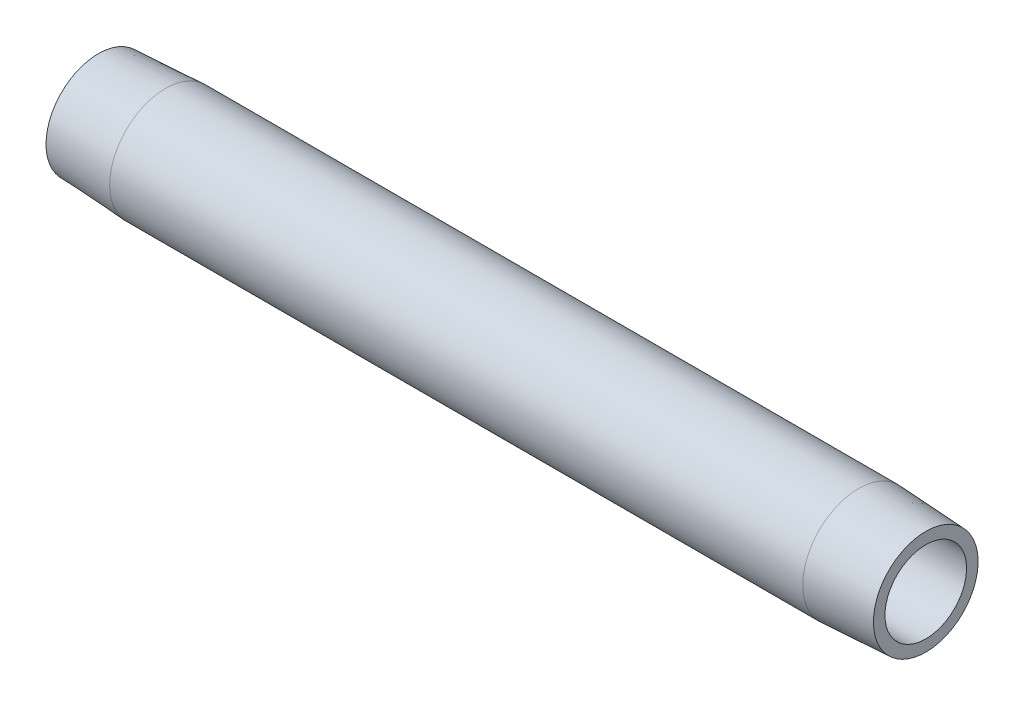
ISO-10303-21;
HEADER;
FILE_DESCRIPTION(('STEP AP214'),'2;1');
FILE_NAME('part.step','',(''),(''),'','','');
FILE_SCHEMA(('AUTOMOTIVE_DESIGN { 1 0 10303 214 1 1 1 1 }'));
ENDSEC;
DATA;
#1=APPLICATION_CONTEXT('core data for automotive mechanical design processes');
#2=APPLICATION_PROTOCOL_DEFINITION('international standard','automotive_design',2000,#1);
#3=PRODUCT_CONTEXT('',#1,'mechanical');
#4=PRODUCT('Part','Part','',(#3));
#5=PRODUCT_RELATED_PRODUCT_CATEGORY('part','',(#4));
#6=PRODUCT_DEFINITION_FORMATION('','',#4);
#7=PRODUCT_DEFINITION_CONTEXT('part definition',#1,'design');
#8=PRODUCT_DEFINITION('design','',#6,#7);
#9=PRODUCT_DEFINITION_SHAPE('','',#8);
#10=(LENGTH_UNIT() NAMED_UNIT(*) SI_UNIT(.MILLI.,.METRE.));
#11=(NAMED_UNIT(*) PLANE_ANGLE_UNIT() SI_UNIT($,.RADIAN.));
#12=(NAMED_UNIT(*) SI_UNIT($,.STERADIAN.) SOLID_ANGLE_UNIT());
#13=UNCERTAINTY_MEASURE_WITH_UNIT(LENGTH_MEASURE(1.E-05),#10,'distance_accuracy_value','');
#14=(GEOMETRIC_REPRESENTATION_CONTEXT(3) GLOBAL_UNCERTAINTY_ASSIGNED_CONTEXT((#13)) GLOBAL_UNIT_ASSIGNED_CONTEXT((#10,
#11,#12)) REPRESENTATION_CONTEXT('',''));
#15=CARTESIAN_POINT('',(0.,0.,0.));
#16=DIRECTION('',(0.,0.,1.));
#17=DIRECTION('',(1.,0.,0.));
#18=AXIS2_PLACEMENT_3D('',#15,#16,#17);
#19=CARTESIAN_POINT('',(127.,6.26110000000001,0.));
#20=DIRECTION('',(-1.,0.,0.));
#21=DIRECTION('',(0.,0.,1.));
#22=AXIS2_PLACEMENT_3D('',#19,#20,#21);
#23=PLANE('',#22);
#24=CARTESIAN_POINT('',(127.,0.,0.));
#25=DIRECTION('',(-1.,0.,0.));
#26=DIRECTION('',(0.,0.,1.));
#27=AXIS2_PLACEMENT_3D('',#24,#25,#26);
#28=CIRCLE('',#27,8.03205001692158);
#29=CARTESIAN_POINT('',(127.,0.,8.03205001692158));
#30=VERTEX_POINT('',#29);
#31=EDGE_CURVE('E10',#30,#30,#28,.T.);
#32=ORIENTED_EDGE('',*,*,#31,.F.);
#33=EDGE_LOOP('',(#32));
#34=FACE_BOUND('',#33,.T.);
#35=CARTESIAN_POINT('',(127.,0.,0.));
#36=DIRECTION('',(-1.,0.,0.));
#37=DIRECTION('',(0.,0.,1.));
#38=AXIS2_PLACEMENT_3D('',#35,#36,#37);
#39=CIRCLE('',#38,6.26110000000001);
#40=CARTESIAN_POINT('',(127.,0.,6.26110000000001));
#41=VERTEX_POINT('',#40);
#42=EDGE_CURVE('E52',#41,#41,#39,.T.);
#43=ORIENTED_EDGE('',*,*,#42,.T.);
#44=EDGE_LOOP('',(#43));
#45=FACE_BOUND('',#44,.T.);
#46=ADVANCED_FACE('F30',(#34,#45),#23,.F.);
#47=CARTESIAN_POINT('',(127.,0.,0.));
#48=DIRECTION('',(-1.,0.,0.));
#49=DIRECTION('',(0.,0.,1.));
#50=AXIS2_PLACEMENT_3D('',#47,#48,#49);
#51=CONICAL_SURFACE('',#50,8.03205001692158,0.0523598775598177);
#52=CARTESIAN_POINT('',(116.6876,0.,0.));
#53=DIRECTION('',(-1.,0.,0.));
#54=DIRECTION('',(0.,0.,1.));
#55=AXIS2_PLACEMENT_3D('',#52,#53,#54);
#56=CIRCLE('',#55,8.57249999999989);
#57=CARTESIAN_POINT('',(116.6876,0.,8.57249999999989));
#58=VERTEX_POINT('',#57);
#59=EDGE_CURVE('E36',#58,#58,#56,.T.);
#60=ORIENTED_EDGE('',*,*,#59,.F.);
#61=EDGE_LOOP('',(#60));
#62=FACE_BOUND('',#61,.T.);
#63=ORIENTED_EDGE('',*,*,#31,.T.);
#64=EDGE_LOOP('',(#63));
#65=FACE_BOUND('',#64,.T.);
#66=ADVANCED_FACE('F77',(#62,#65),#51,.T.);
#67=CARTESIAN_POINT('',(0.,0.,0.));
#68=DIRECTION('',(-1.,0.,0.));
#69=DIRECTION('',(0.,0.,1.));
#70=AXIS2_PLACEMENT_3D('',#67,#68,#69);
#71=CYLINDRICAL_SURFACE('',#70,8.57249999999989);
#72=CARTESIAN_POINT('',(10.3124,0.,0.));
#73=DIRECTION('',(-1.,0.,0.));
#74=DIRECTION('',(0.,0.,1.));
#75=AXIS2_PLACEMENT_3D('',#72,#73,#74);
#76=CIRCLE('',#75,8.57249999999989);
#77=CARTESIAN_POINT('',(10.3124,0.,8.57249999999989));
#78=VERTEX_POINT('',#77);
#79=EDGE_CURVE('E40',#78,#78,#76,.T.);
#80=ORIENTED_EDGE('',*,*,#79,.F.);
#81=EDGE_LOOP('',(#80));
#82=FACE_BOUND('',#81,.T.);
#83=ORIENTED_EDGE('',*,*,#59,.T.);
#84=EDGE_LOOP('',(#83));
#85=FACE_BOUND('',#84,.T.);
#86=ADVANCED_FACE('F72',(#82,#85),#71,.T.);
#87=CARTESIAN_POINT('',(10.3124,0.,0.));
#88=DIRECTION('',(1.,0.,0.));
#89=DIRECTION('',(0.,0.,-1.));
#90=AXIS2_PLACEMENT_3D('',#87,#88,#89);
#91=CONICAL_SURFACE('',#90,8.57249999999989,0.0523598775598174);
#92=CARTESIAN_POINT('',(0.,0.,0.));
#93=DIRECTION('',(-1.,0.,0.));
#94=DIRECTION('',(0.,0.,1.));
#95=AXIS2_PLACEMENT_3D('',#92,#93,#94);
#96=CIRCLE('',#95,8.03205001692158);
#97=CARTESIAN_POINT('',(0.,0.,8.03205001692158));
#98=VERTEX_POINT('',#97);
#99=EDGE_CURVE('E44',#98,#98,#96,.T.);
#100=ORIENTED_EDGE('',*,*,#99,.F.);
#101=EDGE_LOOP('',(#100));
#102=FACE_BOUND('',#101,.T.);
#103=ORIENTED_EDGE('',*,*,#79,.T.);
#104=EDGE_LOOP('',(#103));
#105=FACE_BOUND('',#104,.T.);
#106=ADVANCED_FACE('F66',(#102,#105),#91,.T.);
#107=CARTESIAN_POINT('',(0.,6.26110000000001,0.));
#108=DIRECTION('',(1.,0.,0.));
#109=DIRECTION('',(0.,0.,-1.));
#110=AXIS2_PLACEMENT_3D('',#107,#108,#109);
#111=PLANE('',#110);
#112=CARTESIAN_POINT('',(0.,0.,0.));
#113=DIRECTION('',(-1.,0.,0.));
#114=DIRECTION('',(0.,0.,1.));
#115=AXIS2_PLACEMENT_3D('',#112,#113,#114);
#116=CIRCLE('',#115,6.26110000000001);
#117=CARTESIAN_POINT('',(0.,0.,6.26110000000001));
#118=VERTEX_POINT('',#117);
#119=EDGE_CURVE('E49',#118,#118,#116,.T.);
#120=ORIENTED_EDGE('',*,*,#119,.F.);
#121=EDGE_LOOP('',(#120));
#122=FACE_BOUND('',#121,.T.);
#123=ORIENTED_EDGE('',*,*,#99,.T.);
#124=EDGE_LOOP('',(#123));
#125=FACE_BOUND('',#124,.T.);
#126=ADVANCED_FACE('F60',(#122,#125),#111,.F.);
#127=CARTESIAN_POINT('',(0.,0.,0.));
#128=DIRECTION('',(-1.,0.,0.));
#129=DIRECTION('',(0.,0.,1.));
#130=AXIS2_PLACEMENT_3D('',#127,#128,#129);
#131=CYLINDRICAL_SURFACE('',#130,6.26110000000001);
#132=ORIENTED_EDGE('',*,*,#42,.F.);
#133=EDGE_LOOP('',(#132));
#134=FACE_BOUND('',#133,.T.);
#135=ORIENTED_EDGE('',*,*,#119,.T.);
#136=EDGE_LOOP('',(#135));
#137=FACE_BOUND('',#136,.T.);
#138=ADVANCED_FACE('F57',(#134,#137),#131,.F.);
#139=CLOSED_SHELL('',(#46,#66,#86,#106,#126,#138));
#140=MANIFOLD_SOLID_BREP('B2',#139);
#141=ADVANCED_BREP_SHAPE_REPRESENTATION('',(#18,#140),#14);
#142=SHAPE_DEFINITION_REPRESENTATION(#9,#141);
ENDSEC;
END-ISO-10303-21;
